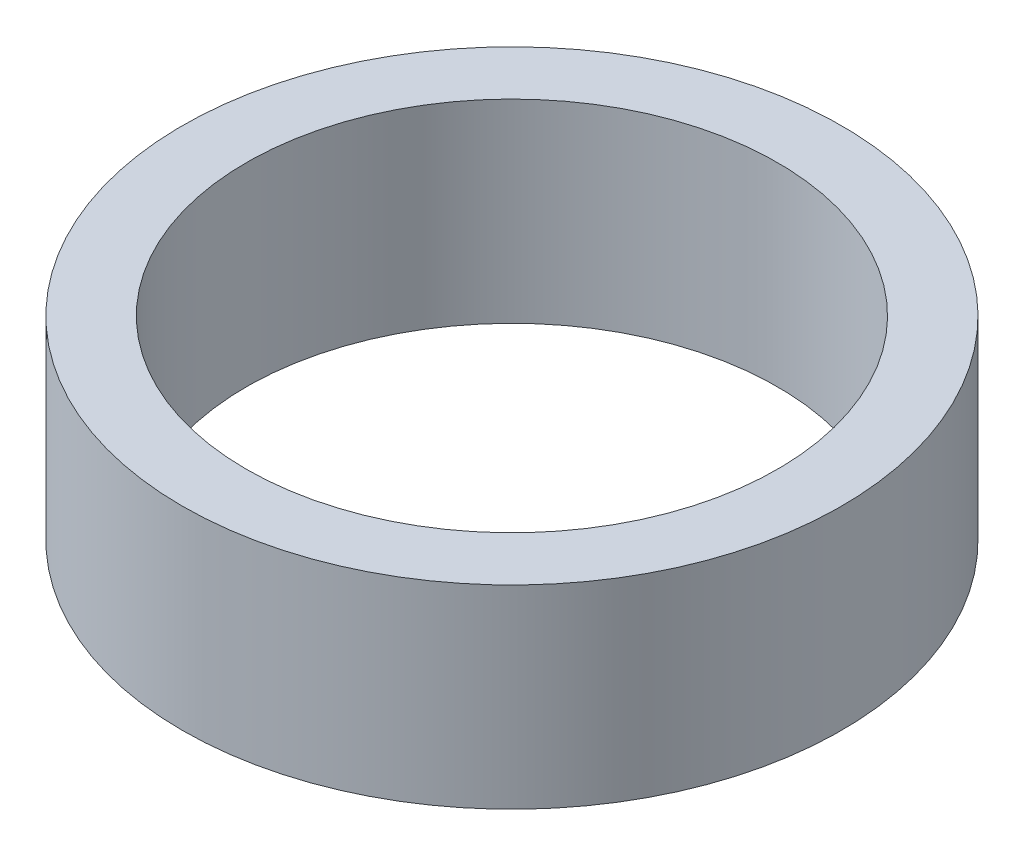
ISO-10303-21;
HEADER;
FILE_DESCRIPTION(('STEP AP214'),'2;1');
FILE_NAME('part.step','',(''),(''),'','','');
FILE_SCHEMA(('AUTOMOTIVE_DESIGN { 1 0 10303 214 1 1 1 1 }'));
ENDSEC;
DATA;
#1=APPLICATION_CONTEXT('core data for automotive mechanical design processes');
#2=APPLICATION_PROTOCOL_DEFINITION('international standard','automotive_design',2000,#1);
#3=PRODUCT_CONTEXT('',#1,'mechanical');
#4=PRODUCT('Part','Part','',(#3));
#5=PRODUCT_RELATED_PRODUCT_CATEGORY('part','',(#4));
#6=PRODUCT_DEFINITION_FORMATION('','',#4);
#7=PRODUCT_DEFINITION_CONTEXT('part definition',#1,'design');
#8=PRODUCT_DEFINITION('design','',#6,#7);
#9=PRODUCT_DEFINITION_SHAPE('','',#8);
#10=(LENGTH_UNIT() NAMED_UNIT(*) SI_UNIT(.MILLI.,.METRE.));
#11=(NAMED_UNIT(*) PLANE_ANGLE_UNIT() SI_UNIT($,.RADIAN.));
#12=(NAMED_UNIT(*) SI_UNIT($,.STERADIAN.) SOLID_ANGLE_UNIT());
#13=UNCERTAINTY_MEASURE_WITH_UNIT(LENGTH_MEASURE(1.E-05),#10,'distance_accuracy_value','');
#14=(GEOMETRIC_REPRESENTATION_CONTEXT(3) GLOBAL_UNCERTAINTY_ASSIGNED_CONTEXT((#13)) GLOBAL_UNIT_ASSIGNED_CONTEXT((#10,
#11,#12)) REPRESENTATION_CONTEXT('',''));
#15=CARTESIAN_POINT('',(0.,0.,0.));
#16=DIRECTION('',(0.,0.,1.));
#17=DIRECTION('',(1.,0.,0.));
#18=AXIS2_PLACEMENT_3D('',#15,#16,#17);
#19=CARTESIAN_POINT('',(0.,0.,0.));
#20=DIRECTION('',(0.,1.,0.));
#21=DIRECTION('',(0.,0.,1.));
#22=AXIS2_PLACEMENT_3D('',#19,#20,#21);
#23=CYLINDRICAL_SURFACE('',#22,9.26253333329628);
#24=CARTESIAN_POINT('',(0.,6.77333333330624,0.));
#25=DIRECTION('',(0.,1.,0.));
#26=DIRECTION('',(0.,0.,1.));
#27=AXIS2_PLACEMENT_3D('',#24,#25,#26);
#28=CIRCLE('',#27,9.26253333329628);
#29=CARTESIAN_POINT('',(0.,6.77333333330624,9.26253333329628));
#30=VERTEX_POINT('',#29);
#31=EDGE_CURVE('E18',#30,#30,#28,.F.);
#32=ORIENTED_EDGE('',*,*,#31,.F.);
#33=EDGE_LOOP('',(#32));
#34=FACE_BOUND('',#33,.T.);
#35=CARTESIAN_POINT('',(0.,0.,0.));
#36=DIRECTION('',(0.,1.,0.));
#37=DIRECTION('',(0.,0.,1.));
#38=AXIS2_PLACEMENT_3D('',#35,#36,#37);
#39=CIRCLE('',#38,9.26253333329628);
#40=CARTESIAN_POINT('',(0.,0.,9.26253333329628));
#41=VERTEX_POINT('',#40);
#42=EDGE_CURVE('E27',#41,#41,#39,.F.);
#43=ORIENTED_EDGE('',*,*,#42,.T.);
#44=EDGE_LOOP('',(#43));
#45=FACE_BOUND('',#44,.T.);
#46=ADVANCED_FACE('F15',(#34,#45),#23,.F.);
#47=CARTESIAN_POINT('',(0.,6.77333333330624,0.));
#48=DIRECTION('',(0.,1.,0.));
#49=DIRECTION('',(0.,0.,1.));
#50=AXIS2_PLACEMENT_3D('',#47,#48,#49);
#51=PLANE('',#50);
#52=ORIENTED_EDGE('',*,*,#31,.T.);
#53=EDGE_LOOP('',(#52));
#54=FACE_BOUND('',#53,.T.);
#55=CARTESIAN_POINT('',(0.,6.77333333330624,0.));
#56=DIRECTION('',(0.,1.,0.));
#57=DIRECTION('',(0.,0.,1.));
#58=AXIS2_PLACEMENT_3D('',#55,#56,#57);
#59=CIRCLE('',#58,11.4935);
#60=CARTESIAN_POINT('',(0.,6.77333333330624,11.4935));
#61=VERTEX_POINT('',#60);
#62=EDGE_CURVE('E22',#61,#61,#59,.F.);
#63=ORIENTED_EDGE('',*,*,#62,.F.);
#64=EDGE_LOOP('',(#63));
#65=FACE_BOUND('',#64,.T.);
#66=ADVANCED_FACE('F35',(#54,#65),#51,.T.);
#67=CARTESIAN_POINT('',(0.,0.,0.));
#68=DIRECTION('',(0.,1.,0.));
#69=DIRECTION('',(0.,0.,1.));
#70=AXIS2_PLACEMENT_3D('',#67,#68,#69);
#71=PLANE('',#70);
#72=ORIENTED_EDGE('',*,*,#42,.F.);
#73=EDGE_LOOP('',(#72));
#74=FACE_BOUND('',#73,.T.);
#75=CARTESIAN_POINT('',(0.,0.,0.));
#76=DIRECTION('',(0.,1.,0.));
#77=DIRECTION('',(0.,0.,1.));
#78=AXIS2_PLACEMENT_3D('',#75,#76,#77);
#79=CIRCLE('',#78,11.4935);
#80=CARTESIAN_POINT('',(0.,0.,11.4935));
#81=VERTEX_POINT('',#80);
#82=EDGE_CURVE('E10',#81,#81,#79,.T.);
#83=ORIENTED_EDGE('',*,*,#82,.F.);
#84=EDGE_LOOP('',(#83));
#85=FACE_BOUND('',#84,.T.);
#86=ADVANCED_FACE('F43',(#74,#85),#71,.F.);
#87=CARTESIAN_POINT('',(0.,0.,0.));
#88=DIRECTION('',(0.,1.,0.));
#89=DIRECTION('',(0.,0.,1.));
#90=AXIS2_PLACEMENT_3D('',#87,#88,#89);
#91=CYLINDRICAL_SURFACE('',#90,11.4935);
#92=ORIENTED_EDGE('',*,*,#62,.T.);
#93=EDGE_LOOP('',(#92));
#94=FACE_BOUND('',#93,.T.);
#95=ORIENTED_EDGE('',*,*,#82,.T.);
#96=EDGE_LOOP('',(#95));
#97=FACE_BOUND('',#96,.T.);
#98=ADVANCED_FACE('F44',(#94,#97),#91,.T.);
#99=CLOSED_SHELL('',(#46,#66,#86,#98));
#100=MANIFOLD_SOLID_BREP('B1',#99);
#101=ADVANCED_BREP_SHAPE_REPRESENTATION('',(#18,#100),#14);
#102=SHAPE_DEFINITION_REPRESENTATION(#9,#101);
ENDSEC;
END-ISO-10303-21;
